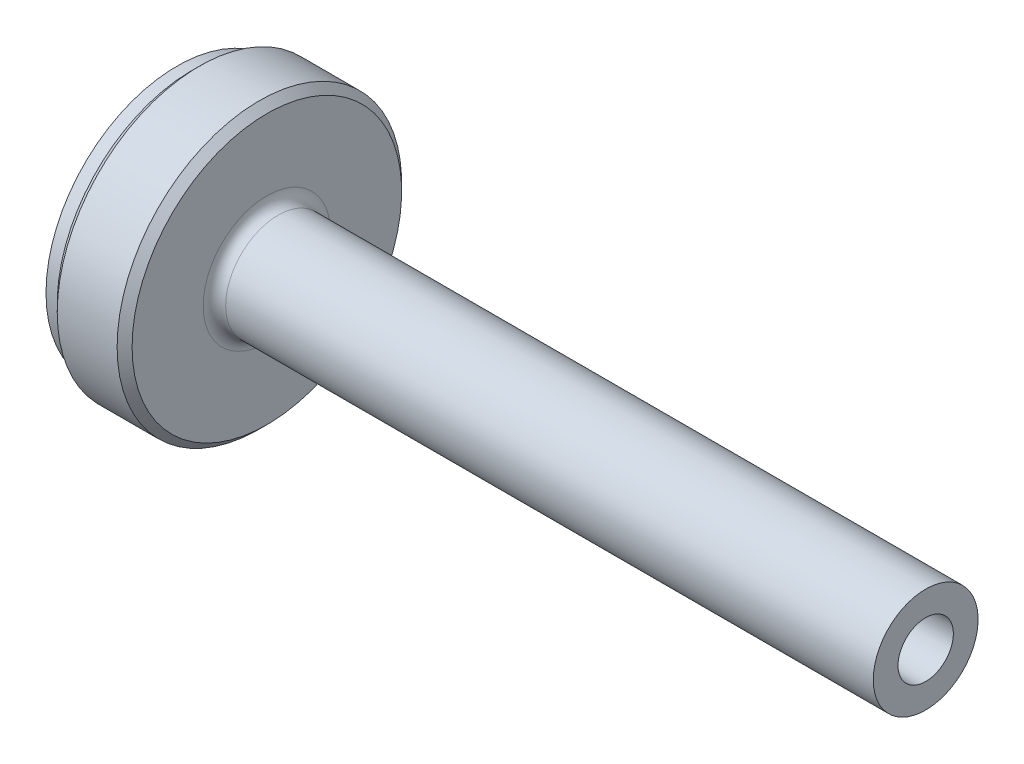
ISO-10303-21;
HEADER;
FILE_DESCRIPTION(('STEP AP214'),'2;1');
FILE_NAME('part.step','',(''),(''),'','','');
FILE_SCHEMA(('AUTOMOTIVE_DESIGN { 1 0 10303 214 1 1 1 1 }'));
ENDSEC;
DATA;
#1=APPLICATION_CONTEXT('core data for automotive mechanical design processes');
#2=APPLICATION_PROTOCOL_DEFINITION('international standard','automotive_design',2000,#1);
#3=PRODUCT_CONTEXT('',#1,'mechanical');
#4=PRODUCT('Part','Part','',(#3));
#5=PRODUCT_RELATED_PRODUCT_CATEGORY('part','',(#4));
#6=PRODUCT_DEFINITION_FORMATION('','',#4);
#7=PRODUCT_DEFINITION_CONTEXT('part definition',#1,'design');
#8=PRODUCT_DEFINITION('design','',#6,#7);
#9=PRODUCT_DEFINITION_SHAPE('','',#8);
#10=(LENGTH_UNIT() NAMED_UNIT(*) SI_UNIT(.MILLI.,.METRE.));
#11=(NAMED_UNIT(*) PLANE_ANGLE_UNIT() SI_UNIT($,.RADIAN.));
#12=(NAMED_UNIT(*) SI_UNIT($,.STERADIAN.) SOLID_ANGLE_UNIT());
#13=UNCERTAINTY_MEASURE_WITH_UNIT(LENGTH_MEASURE(1.E-05),#10,'distance_accuracy_value','');
#14=(GEOMETRIC_REPRESENTATION_CONTEXT(3) GLOBAL_UNCERTAINTY_ASSIGNED_CONTEXT((#13)) GLOBAL_UNIT_ASSIGNED_CONTEXT((#10,
#11,#12)) REPRESENTATION_CONTEXT('',''));
#15=CARTESIAN_POINT('',(0.,0.,0.));
#16=DIRECTION('',(0.,0.,1.));
#17=DIRECTION('',(1.,0.,0.));
#18=AXIS2_PLACEMENT_3D('',#15,#16,#17);
#19=CARTESIAN_POINT('',(100.,7.,0.));
#20=DIRECTION('',(-1.,0.,0.));
#21=DIRECTION('',(0.,0.,1.));
#22=AXIS2_PLACEMENT_3D('',#19,#20,#21);
#23=PLANE('',#22);
#24=CARTESIAN_POINT('',(100.,0.,0.));
#25=DIRECTION('',(-1.,0.,0.));
#26=DIRECTION('',(0.,0.,1.));
#27=AXIS2_PLACEMENT_3D('',#24,#25,#26);
#28=CIRCLE('',#27,7.);
#29=CARTESIAN_POINT('',(100.,0.,7.));
#30=VERTEX_POINT('',#29);
#31=EDGE_CURVE('E40',#30,#30,#28,.T.);
#32=ORIENTED_EDGE('',*,*,#31,.F.);
#33=EDGE_LOOP('',(#32));
#34=FACE_BOUND('',#33,.T.);
#35=CARTESIAN_POINT('',(100.,0.,0.));
#36=DIRECTION('',(-1.,0.,0.));
#37=DIRECTION('',(0.,0.,1.));
#38=AXIS2_PLACEMENT_3D('',#35,#36,#37);
#39=CIRCLE('',#38,3.69314129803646);
#40=CARTESIAN_POINT('',(100.,0.,3.69314129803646));
#41=VERTEX_POINT('',#40);
#42=EDGE_CURVE('E55',#41,#41,#39,.T.);
#43=ORIENTED_EDGE('',*,*,#42,.T.);
#44=EDGE_LOOP('',(#43));
#45=FACE_BOUND('',#44,.T.);
#46=ADVANCED_FACE('F14',(#34,#45),#23,.F.);
#47=CARTESIAN_POINT('',(0.,0.,0.));
#48=DIRECTION('',(-1.,0.,0.));
#49=DIRECTION('',(0.,0.,1.));
#50=AXIS2_PLACEMENT_3D('',#47,#48,#49);
#51=CYLINDRICAL_SURFACE('',#50,7.);
#52=CARTESIAN_POINT('',(13.5,0.,0.));
#53=DIRECTION('',(-1.,0.,0.));
#54=DIRECTION('',(0.,0.,1.));
#55=AXIS2_PLACEMENT_3D('',#52,#53,#54);
#56=CIRCLE('',#55,7.);
#57=CARTESIAN_POINT('',(13.5,0.,7.));
#58=VERTEX_POINT('',#57);
#59=EDGE_CURVE('E9',#58,#58,#56,.F.);
#60=ORIENTED_EDGE('',*,*,#59,.T.);
#61=EDGE_LOOP('',(#60));
#62=FACE_BOUND('',#61,.T.);
#63=ORIENTED_EDGE('',*,*,#31,.T.);
#64=EDGE_LOOP('',(#63));
#65=FACE_BOUND('',#64,.T.);
#66=ADVANCED_FACE('F99',(#62,#65),#51,.T.);
#67=CARTESIAN_POINT('',(12.,19.,0.));
#68=DIRECTION('',(-1.,0.,0.));
#69=DIRECTION('',(0.,0.,1.));
#70=AXIS2_PLACEMENT_3D('',#67,#68,#69);
#71=PLANE('',#70);
#72=CARTESIAN_POINT('',(12.,0.,0.));
#73=DIRECTION('',(-1.,0.,0.));
#74=DIRECTION('',(0.,0.,1.));
#75=AXIS2_PLACEMENT_3D('',#72,#73,#74);
#76=CIRCLE('',#75,8.5);
#77=CARTESIAN_POINT('',(12.,0.,8.5));
#78=VERTEX_POINT('',#77);
#79=EDGE_CURVE('E21',#78,#78,#76,.T.);
#80=ORIENTED_EDGE('',*,*,#79,.T.);
#81=EDGE_LOOP('',(#80));
#82=FACE_BOUND('',#81,.T.);
#83=CARTESIAN_POINT('',(12.,0.,0.));
#84=DIRECTION('',(-1.,0.,0.));
#85=DIRECTION('',(0.,0.,1.));
#86=AXIS2_PLACEMENT_3D('',#83,#84,#85);
#87=CIRCLE('',#86,18.);
#88=CARTESIAN_POINT('',(12.,0.,18.));
#89=VERTEX_POINT('',#88);
#90=EDGE_CURVE('E29',#89,#89,#87,.F.);
#91=ORIENTED_EDGE('',*,*,#90,.T.);
#92=EDGE_LOOP('',(#91));
#93=FACE_BOUND('',#92,.T.);
#94=ADVANCED_FACE('F95',(#82,#93),#71,.F.);
#95=CARTESIAN_POINT('',(0.,0.,0.));
#96=DIRECTION('',(-1.,0.,0.));
#97=DIRECTION('',(0.,0.,1.));
#98=AXIS2_PLACEMENT_3D('',#95,#96,#97);
#99=CYLINDRICAL_SURFACE('',#98,19.);
#100=CARTESIAN_POINT('',(11.,0.,0.));
#101=DIRECTION('',(-1.,0.,0.));
#102=DIRECTION('',(0.,0.,1.));
#103=AXIS2_PLACEMENT_3D('',#100,#101,#102);
#104=CIRCLE('',#103,19.);
#105=CARTESIAN_POINT('',(11.,0.,19.));
#106=VERTEX_POINT('',#105);
#107=EDGE_CURVE('E34',#106,#106,#104,.T.);
#108=ORIENTED_EDGE('',*,*,#107,.T.);
#109=EDGE_LOOP('',(#108));
#110=FACE_BOUND('',#109,.T.);
#111=CARTESIAN_POINT('',(3.,0.,0.));
#112=DIRECTION('',(1.,0.,0.));
#113=DIRECTION('',(0.,0.,-1.));
#114=AXIS2_PLACEMENT_3D('',#111,#112,#113);
#115=CIRCLE('',#114,19.);
#116=CARTESIAN_POINT('',(3.,0.,-19.));
#117=VERTEX_POINT('',#116);
#118=EDGE_CURVE('E37',#117,#117,#115,.T.);
#119=ORIENTED_EDGE('',*,*,#118,.T.);
#120=EDGE_LOOP('',(#119));
#121=FACE_BOUND('',#120,.T.);
#122=ADVANCED_FACE('F87',(#110,#121),#99,.T.);
#123=CARTESIAN_POINT('',(2.,17.5,0.));
#124=DIRECTION('',(1.,0.,0.));
#125=DIRECTION('',(0.,0.,-1.));
#126=AXIS2_PLACEMENT_3D('',#123,#124,#125);
#127=PLANE('',#126);
#128=CARTESIAN_POINT('',(2.,0.,0.));
#129=DIRECTION('',(1.,0.,0.));
#130=DIRECTION('',(0.,0.,-1.));
#131=AXIS2_PLACEMENT_3D('',#128,#129,#130);
#132=CIRCLE('',#131,18.);
#133=CARTESIAN_POINT('',(2.,0.,-18.));
#134=VERTEX_POINT('',#133);
#135=EDGE_CURVE('E25',#134,#134,#132,.F.);
#136=ORIENTED_EDGE('',*,*,#135,.T.);
#137=EDGE_LOOP('',(#136));
#138=FACE_BOUND('',#137,.T.);
#139=CARTESIAN_POINT('',(2.,0.,0.));
#140=DIRECTION('',(-1.,0.,0.));
#141=DIRECTION('',(0.,0.,1.));
#142=AXIS2_PLACEMENT_3D('',#139,#140,#141);
#143=CIRCLE('',#142,17.5);
#144=CARTESIAN_POINT('',(2.,0.,17.5));
#145=VERTEX_POINT('',#144);
#146=EDGE_CURVE('E43',#145,#145,#143,.T.);
#147=ORIENTED_EDGE('',*,*,#146,.F.);
#148=EDGE_LOOP('',(#147));
#149=FACE_BOUND('',#148,.T.);
#150=ADVANCED_FACE('F82',(#138,#149),#127,.F.);
#151=CARTESIAN_POINT('',(0.,0.,0.));
#152=DIRECTION('',(-1.,0.,0.));
#153=DIRECTION('',(0.,0.,1.));
#154=AXIS2_PLACEMENT_3D('',#151,#152,#153);
#155=CYLINDRICAL_SURFACE('',#154,17.5);
#156=CARTESIAN_POINT('',(0.,0.,0.));
#157=DIRECTION('',(-1.,0.,0.));
#158=DIRECTION('',(0.,0.,1.));
#159=AXIS2_PLACEMENT_3D('',#156,#157,#158);
#160=CIRCLE('',#159,17.5);
#161=CARTESIAN_POINT('',(0.,0.,17.5));
#162=VERTEX_POINT('',#161);
#163=EDGE_CURVE('E46',#162,#162,#160,.T.);
#164=ORIENTED_EDGE('',*,*,#163,.F.);
#165=EDGE_LOOP('',(#164));
#166=FACE_BOUND('',#165,.T.);
#167=ORIENTED_EDGE('',*,*,#146,.T.);
#168=EDGE_LOOP('',(#167));
#169=FACE_BOUND('',#168,.T.);
#170=ADVANCED_FACE('F76',(#166,#169),#155,.T.);
#171=CARTESIAN_POINT('',(0.,8.9624151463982,0.));
#172=DIRECTION('',(1.,0.,0.));
#173=DIRECTION('',(0.,0.,-1.));
#174=AXIS2_PLACEMENT_3D('',#171,#172,#173);
#175=PLANE('',#174);
#176=CARTESIAN_POINT('',(0.,0.,0.));
#177=DIRECTION('',(-1.,0.,0.));
#178=DIRECTION('',(0.,0.,1.));
#179=AXIS2_PLACEMENT_3D('',#176,#177,#178);
#180=CIRCLE('',#179,8.9624151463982);
#181=CARTESIAN_POINT('',(0.,0.,8.9624151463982));
#182=VERTEX_POINT('',#181);
#183=EDGE_CURVE('E49',#182,#182,#180,.T.);
#184=ORIENTED_EDGE('',*,*,#183,.F.);
#185=EDGE_LOOP('',(#184));
#186=FACE_BOUND('',#185,.T.);
#187=ORIENTED_EDGE('',*,*,#163,.T.);
#188=EDGE_LOOP('',(#187));
#189=FACE_BOUND('',#188,.T.);
#190=ADVANCED_FACE('F70',(#186,#189),#175,.F.);
#191=CARTESIAN_POINT('',(-11.8284890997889,0.,0.));
#192=DIRECTION('',(-1.,0.,0.));
#193=DIRECTION('',(0.,0.,1.));
#194=AXIS2_PLACEMENT_3D('',#191,#192,#193);
#195=DEGENERATE_TOROIDAL_SURFACE('',#194,0.261837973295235,15.,.F.);
#196=CARTESIAN_POINT('',(3.,0.,0.));
#197=DIRECTION('',(-1.,0.,0.));
#198=DIRECTION('',(0.,0.,1.));
#199=AXIS2_PLACEMENT_3D('',#196,#197,#198);
#200=CIRCLE('',#199,2.);
#201=CARTESIAN_POINT('',(3.,0.,2.));
#202=VERTEX_POINT('',#201);
#203=EDGE_CURVE('E52',#202,#202,#200,.T.);
#204=ORIENTED_EDGE('',*,*,#203,.F.);
#205=EDGE_LOOP('',(#204));
#206=FACE_BOUND('',#205,.T.);
#207=ORIENTED_EDGE('',*,*,#183,.T.);
#208=EDGE_LOOP('',(#207));
#209=FACE_BOUND('',#208,.T.);
#210=ADVANCED_FACE('F64',(#206,#209),#195,.T.);
#211=CARTESIAN_POINT('',(3.,0.,0.));
#212=DIRECTION('',(1.,0.,0.));
#213=DIRECTION('',(0.,0.,-1.));
#214=AXIS2_PLACEMENT_3D('',#211,#212,#213);
#215=CONICAL_SURFACE('',#214,2.,0.0174532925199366);
#216=ORIENTED_EDGE('',*,*,#42,.F.);
#217=EDGE_LOOP('',(#216));
#218=FACE_BOUND('',#217,.T.);
#219=ORIENTED_EDGE('',*,*,#203,.T.);
#220=EDGE_LOOP('',(#219));
#221=FACE_BOUND('',#220,.T.);
#222=ADVANCED_FACE('F60',(#218,#221),#215,.F.);
#223=CARTESIAN_POINT('',(11.,0.,0.));
#224=DIRECTION('',(-1.,0.,0.));
#225=DIRECTION('',(0.,0.,1.));
#226=AXIS2_PLACEMENT_3D('',#223,#224,#225);
#227=CONICAL_SURFACE('',#226,19.,0.78539816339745);
#228=ORIENTED_EDGE('',*,*,#90,.F.);
#229=EDGE_LOOP('',(#228));
#230=FACE_BOUND('',#229,.T.);
#231=ORIENTED_EDGE('',*,*,#107,.F.);
#232=EDGE_LOOP('',(#231));
#233=FACE_BOUND('',#232,.T.);
#234=ADVANCED_FACE('F63',(#230,#233),#227,.T.);
#235=CARTESIAN_POINT('',(2.,0.,0.));
#236=DIRECTION('',(1.,0.,0.));
#237=DIRECTION('',(0.,0.,-1.));
#238=AXIS2_PLACEMENT_3D('',#235,#236,#237);
#239=CONICAL_SURFACE('',#238,18.,0.78539816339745);
#240=ORIENTED_EDGE('',*,*,#118,.F.);
#241=EDGE_LOOP('',(#240));
#242=FACE_BOUND('',#241,.T.);
#243=ORIENTED_EDGE('',*,*,#135,.F.);
#244=EDGE_LOOP('',(#243));
#245=FACE_BOUND('',#244,.T.);
#246=ADVANCED_FACE('F111',(#242,#245),#239,.T.);
#247=CARTESIAN_POINT('',(13.5,0.,0.));
#248=DIRECTION('',(-1.,0.,0.));
#249=DIRECTION('',(0.,0.,1.));
#250=AXIS2_PLACEMENT_3D('',#247,#248,#249);
#251=TOROIDAL_SURFACE('',#250,8.5,1.5);
#252=ORIENTED_EDGE('',*,*,#59,.F.);
#253=EDGE_LOOP('',(#252));
#254=FACE_BOUND('',#253,.T.);
#255=ORIENTED_EDGE('',*,*,#79,.F.);
#256=EDGE_LOOP('',(#255));
#257=FACE_BOUND('',#256,.T.);
#258=ADVANCED_FACE('F16',(#254,#257),#251,.F.);
#259=CLOSED_SHELL('',(#46,#66,#94,#122,#150,#170,#190,#210,#222,#234,#246,#258));
#260=MANIFOLD_SOLID_BREP('B1',#259);
#261=ADVANCED_BREP_SHAPE_REPRESENTATION('',(#18,#260),#14);
#262=SHAPE_DEFINITION_REPRESENTATION(#9,#261);
ENDSEC;
END-ISO-10303-21;
